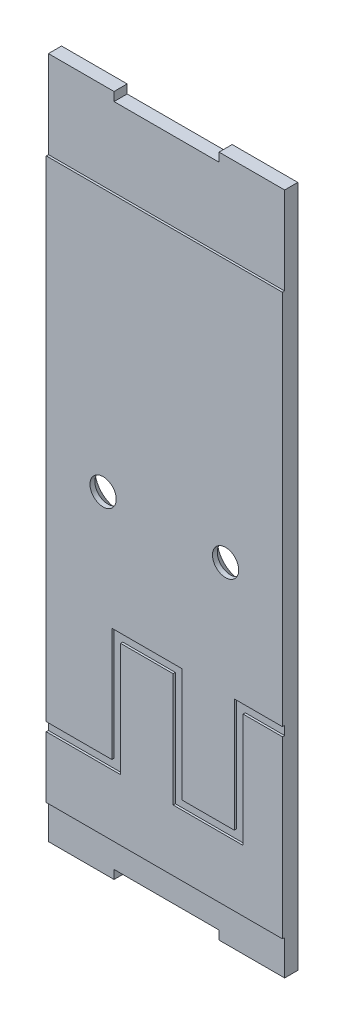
ISO-10303-21;
HEADER;
FILE_DESCRIPTION(('STEP AP214'),'2;1');
FILE_NAME('part.step','',(''),(''),'','','');
FILE_SCHEMA(('AUTOMOTIVE_DESIGN { 1 0 10303 214 1 1 1 1 }'));
ENDSEC;
DATA;
#1=APPLICATION_CONTEXT('core data for automotive mechanical design processes');
#2=APPLICATION_PROTOCOL_DEFINITION('international standard','automotive_design',2000,#1);
#3=PRODUCT_CONTEXT('',#1,'mechanical');
#4=PRODUCT('Part','Part','',(#3));
#5=PRODUCT_RELATED_PRODUCT_CATEGORY('part','',(#4));
#6=PRODUCT_DEFINITION_FORMATION('','',#4);
#7=PRODUCT_DEFINITION_CONTEXT('part definition',#1,'design');
#8=PRODUCT_DEFINITION('design','',#6,#7);
#9=PRODUCT_DEFINITION_SHAPE('','',#8);
#10=(LENGTH_UNIT() NAMED_UNIT(*) SI_UNIT(.MILLI.,.METRE.));
#11=(NAMED_UNIT(*) PLANE_ANGLE_UNIT() SI_UNIT($,.RADIAN.));
#12=(NAMED_UNIT(*) SI_UNIT($,.STERADIAN.) SOLID_ANGLE_UNIT());
#13=UNCERTAINTY_MEASURE_WITH_UNIT(LENGTH_MEASURE(1.E-05),#10,'distance_accuracy_value','');
#14=(GEOMETRIC_REPRESENTATION_CONTEXT(3) GLOBAL_UNCERTAINTY_ASSIGNED_CONTEXT((#13)) GLOBAL_UNIT_ASSIGNED_CONTEXT((#10,
#11,#12)) REPRESENTATION_CONTEXT('',''));
#15=CARTESIAN_POINT('',(0.,0.,0.));
#16=DIRECTION('',(0.,0.,1.));
#17=DIRECTION('',(1.,0.,0.));
#18=AXIS2_PLACEMENT_3D('',#15,#16,#17);
#19=CARTESIAN_POINT('',(0.,0.,1.5));
#20=DIRECTION('',(0.,1.,0.));
#21=DIRECTION('',(0.,0.,1.));
#22=AXIS2_PLACEMENT_3D('',#19,#20,#21);
#23=PLANE('',#22);
#24=DIRECTION('',(1.,0.,0.));
#25=VECTOR('',#24,1.);
#26=CARTESIAN_POINT('',(0.,0.,0.));
#27=LINE('',#26,#25);
#28=CARTESIAN_POINT('',(0.,0.,0.));
#29=VERTEX_POINT('',#28);
#30=CARTESIAN_POINT('',(7.50000000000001,0.,0.));
#31=VERTEX_POINT('',#30);
#32=EDGE_CURVE('E262',#29,#31,#27,.T.);
#33=ORIENTED_EDGE('',*,*,#32,.T.);
#34=DIRECTION('',(0.,0.,1.));
#35=VECTOR('',#34,1.);
#36=CARTESIAN_POINT('',(7.50000000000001,0.,0.));
#37=LINE('',#36,#35);
#38=CARTESIAN_POINT('',(7.50000000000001,0.,1.5));
#39=VERTEX_POINT('',#38);
#40=EDGE_CURVE('E245',#31,#39,#37,.T.);
#41=ORIENTED_EDGE('',*,*,#40,.T.);
#42=DIRECTION('',(1.,0.,0.));
#43=VECTOR('',#42,1.);
#44=CARTESIAN_POINT('',(0.,0.,1.5));
#45=LINE('',#44,#43);
#46=CARTESIAN_POINT('',(0.,0.,1.5));
#47=VERTEX_POINT('',#46);
#48=EDGE_CURVE('E353',#47,#39,#45,.T.);
#49=ORIENTED_EDGE('',*,*,#48,.F.);
#50=DIRECTION('',(0.,0.,-1.));
#51=VECTOR('',#50,1.);
#52=CARTESIAN_POINT('',(0.,0.,1.5));
#53=LINE('',#52,#51);
#54=EDGE_CURVE('E270',#47,#29,#53,.T.);
#55=ORIENTED_EDGE('',*,*,#54,.T.);
#56=EDGE_LOOP('',(#33,#41,#49,#55));
#57=FACE_BOUND('',#56,.T.);
#58=ADVANCED_FACE('F35',(#57),#23,.F.);
#59=CARTESIAN_POINT('',(0.,78.,1.5));
#60=DIRECTION('',(0.,-1.,0.));
#61=DIRECTION('',(0.,0.,-1.));
#62=AXIS2_PLACEMENT_3D('',#59,#60,#61);
#63=PLANE('',#62);
#64=DIRECTION('',(-1.,0.,0.));
#65=VECTOR('',#64,1.);
#66=CARTESIAN_POINT('',(0.,78.,1.5));
#67=LINE('',#66,#65);
#68=CARTESIAN_POINT('',(7.5,78.,1.5));
#69=VERTEX_POINT('',#68);
#70=CARTESIAN_POINT('',(0.,78.,1.5));
#71=VERTEX_POINT('',#70);
#72=EDGE_CURVE('E382',#69,#71,#67,.T.);
#73=ORIENTED_EDGE('',*,*,#72,.F.);
#74=DIRECTION('',(0.,0.,1.));
#75=VECTOR('',#74,1.);
#76=CARTESIAN_POINT('',(7.5,78.,0.));
#77=LINE('',#76,#75);
#78=CARTESIAN_POINT('',(7.5,78.,0.));
#79=VERTEX_POINT('',#78);
#80=EDGE_CURVE('E430',#79,#69,#77,.T.);
#81=ORIENTED_EDGE('',*,*,#80,.F.);
#82=DIRECTION('',(-1.,0.,0.));
#83=VECTOR('',#82,1.);
#84=CARTESIAN_POINT('',(0.,78.,0.));
#85=LINE('',#84,#83);
#86=CARTESIAN_POINT('',(0.,78.,0.));
#87=VERTEX_POINT('',#86);
#88=EDGE_CURVE('E275',#79,#87,#85,.T.);
#89=ORIENTED_EDGE('',*,*,#88,.T.);
#90=DIRECTION('',(0.,0.,-1.));
#91=VECTOR('',#90,1.);
#92=CARTESIAN_POINT('',(0.,78.,1.5));
#93=LINE('',#92,#91);
#94=EDGE_CURVE('E284',#71,#87,#93,.T.);
#95=ORIENTED_EDGE('',*,*,#94,.F.);
#96=EDGE_LOOP('',(#73,#81,#89,#95));
#97=FACE_BOUND('',#96,.T.);
#98=ADVANCED_FACE('F323',(#97),#63,.F.);
#99=CARTESIAN_POINT('',(0.,0.,1.75));
#100=DIRECTION('',(0.,0.,1.));
#101=DIRECTION('',(1.,0.,0.));
#102=AXIS2_PLACEMENT_3D('',#99,#100,#101);
#103=PLANE('',#102);
#104=DIRECTION('',(-1.,0.,0.));
#105=VECTOR('',#104,1.);
#106=CARTESIAN_POINT('',(0.,12.,1.75));
#107=LINE('',#106,#105);
#108=CARTESIAN_POINT('',(7.5,12.,1.75));
#109=VERTEX_POINT('',#108);
#110=CARTESIAN_POINT('',(0.,12.,1.75));
#111=VERTEX_POINT('',#110);
#112=EDGE_CURVE('E519',#109,#111,#107,.T.);
#113=ORIENTED_EDGE('',*,*,#112,.F.);
#114=DIRECTION('',(0.,-1.,0.));
#115=VECTOR('',#114,1.);
#116=CARTESIAN_POINT('',(7.5,25.,1.75));
#117=LINE('',#116,#115);
#118=CARTESIAN_POINT('',(7.5,25.,1.75));
#119=VERTEX_POINT('',#118);
#120=EDGE_CURVE('E516',#119,#109,#117,.T.);
#121=ORIENTED_EDGE('',*,*,#120,.F.);
#122=DIRECTION('',(-1.,0.,0.));
#123=VECTOR('',#122,1.);
#124=CARTESIAN_POINT('',(15.5,25.,1.75));
#125=LINE('',#124,#123);
#126=CARTESIAN_POINT('',(15.5,25.,1.75));
#127=VERTEX_POINT('',#126);
#128=EDGE_CURVE('E513',#127,#119,#125,.T.);
#129=ORIENTED_EDGE('',*,*,#128,.F.);
#130=DIRECTION('',(0.,1.,0.));
#131=VECTOR('',#130,1.);
#132=CARTESIAN_POINT('',(15.5,25.,1.75));
#133=LINE('',#132,#131);
#134=CARTESIAN_POINT('',(15.5,12.,1.75));
#135=VERTEX_POINT('',#134);
#136=EDGE_CURVE('E510',#135,#127,#133,.T.);
#137=ORIENTED_EDGE('',*,*,#136,.F.);
#138=DIRECTION('',(-1.,0.,0.));
#139=VECTOR('',#138,1.);
#140=CARTESIAN_POINT('',(15.5,12.,1.75));
#141=LINE('',#140,#139);
#142=CARTESIAN_POINT('',(21.5,12.,1.75));
#143=VERTEX_POINT('',#142);
#144=EDGE_CURVE('E507',#143,#135,#141,.T.);
#145=ORIENTED_EDGE('',*,*,#144,.F.);
#146=DIRECTION('',(0.,-1.,0.));
#147=VECTOR('',#146,1.);
#148=CARTESIAN_POINT('',(21.5,25.,1.75));
#149=LINE('',#148,#147);
#150=CARTESIAN_POINT('',(21.5,25.,1.75));
#151=VERTEX_POINT('',#150);
#152=EDGE_CURVE('E504',#151,#143,#149,.T.);
#153=ORIENTED_EDGE('',*,*,#152,.F.);
#154=DIRECTION('',(-1.,0.,0.));
#155=VECTOR('',#154,1.);
#156=CARTESIAN_POINT('',(21.5,25.,1.75));
#157=LINE('',#156,#155);
#158=CARTESIAN_POINT('',(27.,25.,1.75));
#159=VERTEX_POINT('',#158);
#160=EDGE_CURVE('E412',#159,#151,#157,.T.);
#161=ORIENTED_EDGE('',*,*,#160,.F.);
#162=DIRECTION('',(0.,1.,0.));
#163=VECTOR('',#162,1.);
#164=CARTESIAN_POINT('',(27.,0.,1.75));
#165=LINE('',#164,#163);
#166=CARTESIAN_POINT('',(27.,68.,1.75));
#167=VERTEX_POINT('',#166);
#168=EDGE_CURVE('E396',#159,#167,#165,.T.);
#169=ORIENTED_EDGE('',*,*,#168,.T.);
#170=DIRECTION('',(1.,0.,0.));
#171=VECTOR('',#170,1.);
#172=CARTESIAN_POINT('',(0.,68.,1.75));
#173=LINE('',#172,#171);
#174=CARTESIAN_POINT('',(0.,68.,1.75));
#175=VERTEX_POINT('',#174);
#176=EDGE_CURVE('E372',#175,#167,#173,.T.);
#177=ORIENTED_EDGE('',*,*,#176,.F.);
#178=DIRECTION('',(0.,-1.,0.));
#179=VECTOR('',#178,1.);
#180=CARTESIAN_POINT('',(0.,78.,1.75));
#181=LINE('',#180,#179);
#182=EDGE_CURVE('E394',#175,#111,#181,.T.);
#183=ORIENTED_EDGE('',*,*,#182,.T.);
#184=EDGE_LOOP('',(#113,#121,#129,#137,#145,#153,#161,#169,#177,#183));
#185=FACE_BOUND('',#184,.T.);
#186=CARTESIAN_POINT('',(6.50000000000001,38.,1.75));
#187=DIRECTION('',(0.,0.,1.));
#188=DIRECTION('',(-1.,0.,0.));
#189=AXIS2_PLACEMENT_3D('',#186,#187,#188);
#190=CIRCLE('',#189,1.5);
#191=CARTESIAN_POINT('',(5.,38.,1.75));
#192=VERTEX_POINT('',#191);
#193=EDGE_CURVE('E528',#192,#192,#190,.T.);
#194=ORIENTED_EDGE('',*,*,#193,.F.);
#195=EDGE_LOOP('',(#194));
#196=FACE_BOUND('',#195,.T.);
#197=CARTESIAN_POINT('',(20.5,38.,1.75));
#198=DIRECTION('',(0.,0.,1.));
#199=DIRECTION('',(1.,0.,0.));
#200=AXIS2_PLACEMENT_3D('',#197,#198,#199);
#201=CIRCLE('',#200,1.5);
#202=CARTESIAN_POINT('',(22.,38.,1.75));
#203=VERTEX_POINT('',#202);
#204=EDGE_CURVE('E368',#203,#203,#201,.T.);
#205=ORIENTED_EDGE('',*,*,#204,.F.);
#206=EDGE_LOOP('',(#205));
#207=FACE_BOUND('',#206,.T.);
#208=ADVANCED_FACE('F330',(#185,#196,#207),#103,.T.);
#209=CARTESIAN_POINT('',(27.,78.,0.));
#210=VERTEX_POINT('',#209);
#211=CARTESIAN_POINT('',(19.5,78.,0.));
#212=VERTEX_POINT('',#211);
#213=EDGE_CURVE('E281',#210,#212,#85,.T.);
#214=ORIENTED_EDGE('',*,*,#213,.T.);
#215=DIRECTION('',(0.,0.,1.));
#216=VECTOR('',#215,1.);
#217=CARTESIAN_POINT('',(19.5,78.,0.));
#218=LINE('',#217,#216);
#219=CARTESIAN_POINT('',(19.5,78.,1.5));
#220=VERTEX_POINT('',#219);
#221=EDGE_CURVE('E425',#212,#220,#218,.T.);
#222=ORIENTED_EDGE('',*,*,#221,.T.);
#223=CARTESIAN_POINT('',(27.,78.,1.5));
#224=VERTEX_POINT('',#223);
#225=EDGE_CURVE('E383',#224,#220,#67,.T.);
#226=ORIENTED_EDGE('',*,*,#225,.F.);
#227=DIRECTION('',(0.,0.,-1.));
#228=VECTOR('',#227,1.);
#229=CARTESIAN_POINT('',(27.,78.,1.5));
#230=LINE('',#229,#228);
#231=EDGE_CURVE('E287',#224,#210,#230,.T.);
#232=ORIENTED_EDGE('',*,*,#231,.T.);
#233=EDGE_LOOP('',(#214,#222,#226,#232));
#234=FACE_BOUND('',#233,.T.);
#235=ADVANCED_FACE('F333',(#234),#63,.F.);
#236=CARTESIAN_POINT('',(0.,0.,1.5));
#237=DIRECTION('',(1.,0.,0.));
#238=DIRECTION('',(0.,0.,-1.));
#239=AXIS2_PLACEMENT_3D('',#236,#237,#238);
#240=PLANE('',#239);
#241=CARTESIAN_POINT('',(0.,11.,1.75));
#242=VERTEX_POINT('',#241);
#243=CARTESIAN_POINT('',(0.,4.,1.75));
#244=VERTEX_POINT('',#243);
#245=EDGE_CURVE('E392',#242,#244,#181,.T.);
#246=ORIENTED_EDGE('',*,*,#245,.F.);
#247=DIRECTION('',(0.,0.,1.));
#248=VECTOR('',#247,1.);
#249=CARTESIAN_POINT('',(0.,11.,1.5));
#250=LINE('',#249,#248);
#251=CARTESIAN_POINT('',(0.,11.,1.5));
#252=VERTEX_POINT('',#251);
#253=EDGE_CURVE('E531',#252,#242,#250,.T.);
#254=ORIENTED_EDGE('',*,*,#253,.F.);
#255=DIRECTION('',(0.,-1.,0.));
#256=VECTOR('',#255,1.);
#257=CARTESIAN_POINT('',(0.,12.,1.5));
#258=LINE('',#257,#256);
#259=CARTESIAN_POINT('',(0.,12.,1.5));
#260=VERTEX_POINT('',#259);
#261=EDGE_CURVE('E481',#260,#252,#258,.T.);
#262=ORIENTED_EDGE('',*,*,#261,.F.);
#263=DIRECTION('',(0.,0.,1.));
#264=VECTOR('',#263,1.);
#265=CARTESIAN_POINT('',(0.,12.,1.5));
#266=LINE('',#265,#264);
#267=EDGE_CURVE('E533',#260,#111,#266,.T.);
#268=ORIENTED_EDGE('',*,*,#267,.T.);
#269=ORIENTED_EDGE('',*,*,#182,.F.);
#270=DIRECTION('',(0.,0.,1.));
#271=VECTOR('',#270,1.);
#272=CARTESIAN_POINT('',(0.,68.,1.5));
#273=LINE('',#272,#271);
#274=CARTESIAN_POINT('',(0.,68.,1.5));
#275=VERTEX_POINT('',#274);
#276=EDGE_CURVE('E386',#275,#175,#273,.T.);
#277=ORIENTED_EDGE('',*,*,#276,.F.);
#278=DIRECTION('',(0.,-1.,0.));
#279=VECTOR('',#278,1.);
#280=CARTESIAN_POINT('',(0.,78.,1.5));
#281=LINE('',#280,#279);
#282=EDGE_CURVE('E374',#71,#275,#281,.T.);
#283=ORIENTED_EDGE('',*,*,#282,.F.);
#284=ORIENTED_EDGE('',*,*,#94,.T.);
#285=DIRECTION('',(0.,-1.,0.));
#286=VECTOR('',#285,1.);
#287=CARTESIAN_POINT('',(0.,0.,0.));
#288=LINE('',#287,#286);
#289=EDGE_CURVE('E277',#87,#29,#288,.T.);
#290=ORIENTED_EDGE('',*,*,#289,.T.);
#291=ORIENTED_EDGE('',*,*,#54,.F.);
#292=DIRECTION('',(0.,-1.,0.));
#293=VECTOR('',#292,1.);
#294=CARTESIAN_POINT('',(0.,0.,1.5));
#295=LINE('',#294,#293);
#296=CARTESIAN_POINT('',(0.,4.,1.5));
#297=VERTEX_POINT('',#296);
#298=EDGE_CURVE('E354',#297,#47,#295,.T.);
#299=ORIENTED_EDGE('',*,*,#298,.F.);
#300=DIRECTION('',(0.,0.,1.));
#301=VECTOR('',#300,1.);
#302=CARTESIAN_POINT('',(0.,4.,1.5));
#303=LINE('',#302,#301);
#304=EDGE_CURVE('E369',#297,#244,#303,.T.);
#305=ORIENTED_EDGE('',*,*,#304,.T.);
#306=EDGE_LOOP('',(#246,#254,#262,#268,#269,#277,#283,#284,#290,#291,#299,#305));
#307=FACE_BOUND('',#306,.T.);
#308=ADVANCED_FACE('F337',(#307),#240,.F.);
#309=CARTESIAN_POINT('',(19.5,0.,1.5));
#310=VERTEX_POINT('',#309);
#311=CARTESIAN_POINT('',(27.,0.,1.5));
#312=VERTEX_POINT('',#311);
#313=EDGE_CURVE('E349',#310,#312,#45,.T.);
#314=ORIENTED_EDGE('',*,*,#313,.F.);
#315=DIRECTION('',(0.,0.,1.));
#316=VECTOR('',#315,1.);
#317=CARTESIAN_POINT('',(19.5,0.,0.));
#318=LINE('',#317,#316);
#319=CARTESIAN_POINT('',(19.5,0.,0.));
#320=VERTEX_POINT('',#319);
#321=EDGE_CURVE('E50',#320,#310,#318,.T.);
#322=ORIENTED_EDGE('',*,*,#321,.F.);
#323=CARTESIAN_POINT('',(27.,0.,0.));
#324=VERTEX_POINT('',#323);
#325=EDGE_CURVE('E272',#320,#324,#27,.T.);
#326=ORIENTED_EDGE('',*,*,#325,.T.);
#327=DIRECTION('',(0.,0.,-1.));
#328=VECTOR('',#327,1.);
#329=CARTESIAN_POINT('',(27.,0.,1.5));
#330=LINE('',#329,#328);
#331=EDGE_CURVE('E289',#312,#324,#330,.T.);
#332=ORIENTED_EDGE('',*,*,#331,.F.);
#333=EDGE_LOOP('',(#314,#322,#326,#332));
#334=FACE_BOUND('',#333,.T.);
#335=ADVANCED_FACE('F325',(#334),#23,.F.);
#336=CARTESIAN_POINT('',(27.,0.,1.5));
#337=DIRECTION('',(-1.,0.,0.));
#338=DIRECTION('',(0.,0.,1.));
#339=AXIS2_PLACEMENT_3D('',#336,#337,#338);
#340=PLANE('',#339);
#341=ORIENTED_EDGE('',*,*,#168,.F.);
#342=DIRECTION('',(0.,0.,1.));
#343=VECTOR('',#342,1.);
#344=CARTESIAN_POINT('',(27.,25.,1.5));
#345=LINE('',#344,#343);
#346=CARTESIAN_POINT('',(27.,25.,1.5));
#347=VERTEX_POINT('',#346);
#348=EDGE_CURVE('E548',#347,#159,#345,.T.);
#349=ORIENTED_EDGE('',*,*,#348,.F.);
#350=DIRECTION('',(0.,1.,0.));
#351=VECTOR('',#350,1.);
#352=CARTESIAN_POINT('',(27.,25.,1.5));
#353=LINE('',#352,#351);
#354=CARTESIAN_POINT('',(27.,24.,1.5));
#355=VERTEX_POINT('',#354);
#356=EDGE_CURVE('E457',#355,#347,#353,.T.);
#357=ORIENTED_EDGE('',*,*,#356,.F.);
#358=DIRECTION('',(0.,0.,1.));
#359=VECTOR('',#358,1.);
#360=CARTESIAN_POINT('',(27.,24.,1.5));
#361=LINE('',#360,#359);
#362=CARTESIAN_POINT('',(27.,24.,1.75));
#363=VERTEX_POINT('',#362);
#364=EDGE_CURVE('E550',#355,#363,#361,.T.);
#365=ORIENTED_EDGE('',*,*,#364,.T.);
#366=CARTESIAN_POINT('',(27.,4.,1.75));
#367=VERTEX_POINT('',#366);
#368=EDGE_CURVE('E397',#367,#363,#165,.T.);
#369=ORIENTED_EDGE('',*,*,#368,.F.);
#370=DIRECTION('',(0.,0.,1.));
#371=VECTOR('',#370,1.);
#372=CARTESIAN_POINT('',(27.,4.,1.5));
#373=LINE('',#372,#371);
#374=CARTESIAN_POINT('',(27.,4.,1.5));
#375=VERTEX_POINT('',#374);
#376=EDGE_CURVE('E365',#375,#367,#373,.T.);
#377=ORIENTED_EDGE('',*,*,#376,.F.);
#378=DIRECTION('',(0.,1.,0.));
#379=VECTOR('',#378,1.);
#380=CARTESIAN_POINT('',(27.,0.,1.5));
#381=LINE('',#380,#379);
#382=EDGE_CURVE('E356',#312,#375,#381,.T.);
#383=ORIENTED_EDGE('',*,*,#382,.F.);
#384=ORIENTED_EDGE('',*,*,#331,.T.);
#385=DIRECTION('',(0.,1.,0.));
#386=VECTOR('',#385,1.);
#387=CARTESIAN_POINT('',(27.,0.,0.));
#388=LINE('',#387,#386);
#389=EDGE_CURVE('E271',#324,#210,#388,.T.);
#390=ORIENTED_EDGE('',*,*,#389,.T.);
#391=ORIENTED_EDGE('',*,*,#231,.F.);
#392=DIRECTION('',(0.,1.,0.));
#393=VECTOR('',#392,1.);
#394=CARTESIAN_POINT('',(27.,78.,1.5));
#395=LINE('',#394,#393);
#396=CARTESIAN_POINT('',(27.,68.,1.5));
#397=VERTEX_POINT('',#396);
#398=EDGE_CURVE('E380',#397,#224,#395,.T.);
#399=ORIENTED_EDGE('',*,*,#398,.F.);
#400=DIRECTION('',(0.,0.,1.));
#401=VECTOR('',#400,1.);
#402=CARTESIAN_POINT('',(27.,68.,1.5));
#403=LINE('',#402,#401);
#404=EDGE_CURVE('E389',#397,#167,#403,.T.);
#405=ORIENTED_EDGE('',*,*,#404,.T.);
#406=EDGE_LOOP('',(#341,#349,#357,#365,#369,#377,#383,#384,#390,#391,#399,#405));
#407=FACE_BOUND('',#406,.T.);
#408=ADVANCED_FACE('F313',(#407),#340,.F.);
#409=CARTESIAN_POINT('',(0.,0.,0.));
#410=DIRECTION('',(0.,0.,-1.));
#411=DIRECTION('',(-1.,0.,0.));
#412=AXIS2_PLACEMENT_3D('',#409,#410,#411);
#413=PLANE('',#412);
#414=CARTESIAN_POINT('',(6.50000000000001,38.,0.));
#415=DIRECTION('',(0.,0.,-1.));
#416=DIRECTION('',(-1.,0.,0.));
#417=AXIS2_PLACEMENT_3D('',#414,#415,#416);
#418=CIRCLE('',#417,2.70000000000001);
#419=CARTESIAN_POINT('',(3.8,38.,0.));
#420=VERTEX_POINT('',#419);
#421=EDGE_CURVE('E296',#420,#420,#418,.F.);
#422=ORIENTED_EDGE('',*,*,#421,.T.);
#423=EDGE_LOOP('',(#422));
#424=FACE_BOUND('',#423,.T.);
#425=CARTESIAN_POINT('',(20.5,38.,0.));
#426=DIRECTION('',(0.,0.,-1.));
#427=DIRECTION('',(-1.,0.,0.));
#428=AXIS2_PLACEMENT_3D('',#425,#426,#427);
#429=CIRCLE('',#428,2.7);
#430=CARTESIAN_POINT('',(17.8,38.,0.));
#431=VERTEX_POINT('',#430);
#432=EDGE_CURVE('E293',#431,#431,#429,.F.);
#433=ORIENTED_EDGE('',*,*,#432,.T.);
#434=EDGE_LOOP('',(#433));
#435=FACE_BOUND('',#434,.T.);
#436=DIRECTION('',(0.,-1.,0.));
#437=VECTOR('',#436,1.);
#438=CARTESIAN_POINT('',(7.50000000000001,0.,0.));
#439=LINE('',#438,#437);
#440=CARTESIAN_POINT('',(7.50000000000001,1.,0.));
#441=VERTEX_POINT('',#440);
#442=EDGE_CURVE('E248',#441,#31,#439,.T.);
#443=ORIENTED_EDGE('',*,*,#442,.T.);
#444=ORIENTED_EDGE('',*,*,#32,.F.);
#445=ORIENTED_EDGE('',*,*,#289,.F.);
#446=ORIENTED_EDGE('',*,*,#88,.F.);
#447=DIRECTION('',(0.,-1.,0.));
#448=VECTOR('',#447,1.);
#449=CARTESIAN_POINT('',(7.5,78.,0.));
#450=LINE('',#449,#448);
#451=CARTESIAN_POINT('',(7.5,77.,0.));
#452=VERTEX_POINT('',#451);
#453=EDGE_CURVE('E945',#79,#452,#450,.T.);
#454=ORIENTED_EDGE('',*,*,#453,.T.);
#455=DIRECTION('',(1.,0.,0.));
#456=VECTOR('',#455,1.);
#457=CARTESIAN_POINT('',(7.5,77.,0.));
#458=LINE('',#457,#456);
#459=CARTESIAN_POINT('',(19.5,77.,0.));
#460=VERTEX_POINT('',#459);
#461=EDGE_CURVE('E948',#452,#460,#458,.T.);
#462=ORIENTED_EDGE('',*,*,#461,.T.);
#463=DIRECTION('',(0.,1.,0.));
#464=VECTOR('',#463,1.);
#465=CARTESIAN_POINT('',(19.5,78.,0.));
#466=LINE('',#465,#464);
#467=EDGE_CURVE('E440',#460,#212,#466,.T.);
#468=ORIENTED_EDGE('',*,*,#467,.T.);
#469=ORIENTED_EDGE('',*,*,#213,.F.);
#470=ORIENTED_EDGE('',*,*,#389,.F.);
#471=ORIENTED_EDGE('',*,*,#325,.F.);
#472=DIRECTION('',(0.,1.,0.));
#473=VECTOR('',#472,1.);
#474=CARTESIAN_POINT('',(19.5,0.,0.));
#475=LINE('',#474,#473);
#476=CARTESIAN_POINT('',(19.5,1.,0.));
#477=VERTEX_POINT('',#476);
#478=EDGE_CURVE('E266',#320,#477,#475,.T.);
#479=ORIENTED_EDGE('',*,*,#478,.T.);
#480=DIRECTION('',(-1.,0.,0.));
#481=VECTOR('',#480,1.);
#482=CARTESIAN_POINT('',(7.50000000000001,1.,0.));
#483=LINE('',#482,#481);
#484=EDGE_CURVE('E256',#477,#441,#483,.T.);
#485=ORIENTED_EDGE('',*,*,#484,.T.);
#486=EDGE_LOOP('',(#443,#444,#445,#446,#454,#462,#468,#469,#470,#471,#479,#485));
#487=FACE_BOUND('',#486,.T.);
#488=ADVANCED_FACE('F260',(#424,#435,#487),#413,.T.);
#489=DIRECTION('',(1.,0.,0.));
#490=VECTOR('',#489,1.);
#491=CARTESIAN_POINT('',(8.5,11.,1.75));
#492=LINE('',#491,#490);
#493=CARTESIAN_POINT('',(8.5,11.,1.75));
#494=VERTEX_POINT('',#493);
#495=EDGE_CURVE('E521',#242,#494,#492,.T.);
#496=ORIENTED_EDGE('',*,*,#495,.F.);
#497=ORIENTED_EDGE('',*,*,#245,.T.);
#498=DIRECTION('',(-1.,0.,0.));
#499=VECTOR('',#498,1.);
#500=CARTESIAN_POINT('',(0.,4.,1.75));
#501=LINE('',#500,#499);
#502=EDGE_CURVE('E357',#367,#244,#501,.T.);
#503=ORIENTED_EDGE('',*,*,#502,.F.);
#504=ORIENTED_EDGE('',*,*,#368,.T.);
#505=DIRECTION('',(1.,0.,0.));
#506=VECTOR('',#505,1.);
#507=CARTESIAN_POINT('',(22.5,24.,1.75));
#508=LINE('',#507,#506);
#509=CARTESIAN_POINT('',(22.5,24.,1.75));
#510=VERTEX_POINT('',#509);
#511=EDGE_CURVE('E501',#510,#363,#508,.T.);
#512=ORIENTED_EDGE('',*,*,#511,.F.);
#513=DIRECTION('',(0.,1.,0.));
#514=VECTOR('',#513,1.);
#515=CARTESIAN_POINT('',(22.5,24.,1.75));
#516=LINE('',#515,#514);
#517=CARTESIAN_POINT('',(22.5,11.,1.75));
#518=VERTEX_POINT('',#517);
#519=EDGE_CURVE('E498',#518,#510,#516,.T.);
#520=ORIENTED_EDGE('',*,*,#519,.F.);
#521=DIRECTION('',(1.,0.,0.));
#522=VECTOR('',#521,1.);
#523=CARTESIAN_POINT('',(22.5,11.,1.75));
#524=LINE('',#523,#522);
#525=CARTESIAN_POINT('',(14.5,11.,1.75));
#526=VERTEX_POINT('',#525);
#527=EDGE_CURVE('E495',#526,#518,#524,.T.);
#528=ORIENTED_EDGE('',*,*,#527,.F.);
#529=DIRECTION('',(0.,-1.,0.));
#530=VECTOR('',#529,1.);
#531=CARTESIAN_POINT('',(14.5,24.,1.75));
#532=LINE('',#531,#530);
#533=CARTESIAN_POINT('',(14.5,24.,1.75));
#534=VERTEX_POINT('',#533);
#535=EDGE_CURVE('E492',#534,#526,#532,.T.);
#536=ORIENTED_EDGE('',*,*,#535,.F.);
#537=DIRECTION('',(1.,0.,0.));
#538=VECTOR('',#537,1.);
#539=CARTESIAN_POINT('',(8.5,24.,1.75));
#540=LINE('',#539,#538);
#541=CARTESIAN_POINT('',(8.5,24.,1.75));
#542=VERTEX_POINT('',#541);
#543=EDGE_CURVE('E433',#542,#534,#540,.T.);
#544=ORIENTED_EDGE('',*,*,#543,.F.);
#545=DIRECTION('',(0.,1.,0.));
#546=VECTOR('',#545,1.);
#547=CARTESIAN_POINT('',(8.5,24.,1.75));
#548=LINE('',#547,#546);
#549=EDGE_CURVE('E445',#494,#542,#548,.T.);
#550=ORIENTED_EDGE('',*,*,#549,.F.);
#551=EDGE_LOOP('',(#496,#497,#503,#504,#512,#520,#528,#536,#544,#550));
#552=FACE_BOUND('',#551,.T.);
#553=ADVANCED_FACE('F312',(#552),#103,.T.);
#554=CARTESIAN_POINT('',(0.,68.,1.5));
#555=DIRECTION('',(0.,-1.,0.));
#556=DIRECTION('',(0.,0.,-1.));
#557=AXIS2_PLACEMENT_3D('',#554,#555,#556);
#558=PLANE('',#557);
#559=ORIENTED_EDGE('',*,*,#176,.T.);
#560=ORIENTED_EDGE('',*,*,#404,.F.);
#561=DIRECTION('',(1.,0.,0.));
#562=VECTOR('',#561,1.);
#563=CARTESIAN_POINT('',(0.,68.,1.5));
#564=LINE('',#563,#562);
#565=EDGE_CURVE('E377',#275,#397,#564,.T.);
#566=ORIENTED_EDGE('',*,*,#565,.F.);
#567=ORIENTED_EDGE('',*,*,#276,.T.);
#568=EDGE_LOOP('',(#559,#560,#566,#567));
#569=FACE_BOUND('',#568,.T.);
#570=ADVANCED_FACE('F415',(#569),#558,.F.);
#571=CARTESIAN_POINT('',(0.,0.,1.5));
#572=DIRECTION('',(0.,0.,1.));
#573=DIRECTION('',(1.,0.,0.));
#574=AXIS2_PLACEMENT_3D('',#571,#572,#573);
#575=PLANE('',#574);
#576=DIRECTION('',(0.,-1.,0.));
#577=VECTOR('',#576,1.);
#578=CARTESIAN_POINT('',(7.5,78.,1.5));
#579=LINE('',#578,#577);
#580=CARTESIAN_POINT('',(7.5,77.,1.5));
#581=VERTEX_POINT('',#580);
#582=EDGE_CURVE('E58',#69,#581,#579,.T.);
#583=ORIENTED_EDGE('',*,*,#582,.F.);
#584=ORIENTED_EDGE('',*,*,#72,.T.);
#585=ORIENTED_EDGE('',*,*,#282,.T.);
#586=ORIENTED_EDGE('',*,*,#565,.T.);
#587=ORIENTED_EDGE('',*,*,#398,.T.);
#588=ORIENTED_EDGE('',*,*,#225,.T.);
#589=DIRECTION('',(0.,1.,0.));
#590=VECTOR('',#589,1.);
#591=CARTESIAN_POINT('',(19.5,78.,1.5));
#592=LINE('',#591,#590);
#593=CARTESIAN_POINT('',(19.5,77.,1.5));
#594=VERTEX_POINT('',#593);
#595=EDGE_CURVE('E949',#594,#220,#592,.T.);
#596=ORIENTED_EDGE('',*,*,#595,.F.);
#597=DIRECTION('',(1.,0.,0.));
#598=VECTOR('',#597,1.);
#599=CARTESIAN_POINT('',(7.5,77.,1.5));
#600=LINE('',#599,#598);
#601=EDGE_CURVE('E954',#581,#594,#600,.T.);
#602=ORIENTED_EDGE('',*,*,#601,.F.);
#603=EDGE_LOOP('',(#583,#584,#585,#586,#587,#588,#596,#602));
#604=FACE_BOUND('',#603,.T.);
#605=ADVANCED_FACE('F421',(#604),#575,.T.);
#606=CARTESIAN_POINT('',(0.,4.,1.5));
#607=DIRECTION('',(0.,1.,0.));
#608=DIRECTION('',(0.,0.,1.));
#609=AXIS2_PLACEMENT_3D('',#606,#607,#608);
#610=PLANE('',#609);
#611=ORIENTED_EDGE('',*,*,#502,.T.);
#612=ORIENTED_EDGE('',*,*,#304,.F.);
#613=DIRECTION('',(-1.,0.,0.));
#614=VECTOR('',#613,1.);
#615=CARTESIAN_POINT('',(0.,4.,1.5));
#616=LINE('',#615,#614);
#617=EDGE_CURVE('E362',#375,#297,#616,.T.);
#618=ORIENTED_EDGE('',*,*,#617,.F.);
#619=ORIENTED_EDGE('',*,*,#376,.T.);
#620=EDGE_LOOP('',(#611,#612,#618,#619));
#621=FACE_BOUND('',#620,.T.);
#622=ADVANCED_FACE('F588',(#621),#610,.F.);
#623=CARTESIAN_POINT('',(0.,0.,1.5));
#624=DIRECTION('',(0.,0.,-1.));
#625=DIRECTION('',(-1.,0.,0.));
#626=AXIS2_PLACEMENT_3D('',#623,#624,#625);
#627=PLANE('',#626);
#628=ORIENTED_EDGE('',*,*,#48,.T.);
#629=DIRECTION('',(0.,-1.,0.));
#630=VECTOR('',#629,1.);
#631=CARTESIAN_POINT('',(7.50000000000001,0.,1.5));
#632=LINE('',#631,#630);
#633=CARTESIAN_POINT('',(7.50000000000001,1.,1.5));
#634=VERTEX_POINT('',#633);
#635=EDGE_CURVE('E251',#634,#39,#632,.T.);
#636=ORIENTED_EDGE('',*,*,#635,.F.);
#637=DIRECTION('',(-1.,0.,0.));
#638=VECTOR('',#637,1.);
#639=CARTESIAN_POINT('',(7.50000000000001,1.,1.5));
#640=LINE('',#639,#638);
#641=CARTESIAN_POINT('',(19.5,1.,1.5));
#642=VERTEX_POINT('',#641);
#643=EDGE_CURVE('E267',#642,#634,#640,.T.);
#644=ORIENTED_EDGE('',*,*,#643,.F.);
#645=DIRECTION('',(0.,1.,0.));
#646=VECTOR('',#645,1.);
#647=CARTESIAN_POINT('',(19.5,0.,1.5));
#648=LINE('',#647,#646);
#649=EDGE_CURVE('E933',#310,#642,#648,.T.);
#650=ORIENTED_EDGE('',*,*,#649,.F.);
#651=ORIENTED_EDGE('',*,*,#313,.T.);
#652=ORIENTED_EDGE('',*,*,#382,.T.);
#653=ORIENTED_EDGE('',*,*,#617,.T.);
#654=ORIENTED_EDGE('',*,*,#298,.T.);
#655=EDGE_LOOP('',(#628,#636,#644,#650,#651,#652,#653,#654));
#656=FACE_BOUND('',#655,.T.);
#657=ADVANCED_FACE('F590',(#656),#627,.F.);
#658=CARTESIAN_POINT('',(20.5,38.,0.));
#659=DIRECTION('',(0.,0.,1.));
#660=DIRECTION('',(1.,0.,0.));
#661=AXIS2_PLACEMENT_3D('',#658,#659,#660);
#662=CYLINDRICAL_SURFACE('',#661,1.5);
#663=CARTESIAN_POINT('',(20.5,38.,1.20000000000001));
#664=DIRECTION('',(0.,0.,-1.));
#665=DIRECTION('',(-1.,0.,0.));
#666=AXIS2_PLACEMENT_3D('',#663,#664,#665);
#667=CIRCLE('',#666,1.5);
#668=CARTESIAN_POINT('',(19.,38.,1.20000000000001));
#669=VERTEX_POINT('',#668);
#670=EDGE_CURVE('E11',#669,#669,#667,.T.);
#671=ORIENTED_EDGE('',*,*,#670,.T.);
#672=EDGE_LOOP('',(#671));
#673=FACE_BOUND('',#672,.T.);
#674=ORIENTED_EDGE('',*,*,#204,.T.);
#675=EDGE_LOOP('',(#674));
#676=FACE_BOUND('',#675,.T.);
#677=ADVANCED_FACE('F565',(#673,#676),#662,.F.);
#678=CARTESIAN_POINT('',(6.50000000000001,38.,0.));
#679=DIRECTION('',(0.,0.,1.));
#680=DIRECTION('',(1.,0.,0.));
#681=AXIS2_PLACEMENT_3D('',#678,#679,#680);
#682=CYLINDRICAL_SURFACE('',#681,1.5);
#683=CARTESIAN_POINT('',(6.50000000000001,38.,1.2));
#684=DIRECTION('',(0.,0.,-1.));
#685=DIRECTION('',(-1.,0.,0.));
#686=AXIS2_PLACEMENT_3D('',#683,#684,#685);
#687=CIRCLE('',#686,1.5);
#688=CARTESIAN_POINT('',(5.00000000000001,38.,1.2));
#689=VERTEX_POINT('',#688);
#690=EDGE_CURVE('E43',#689,#689,#687,.T.);
#691=ORIENTED_EDGE('',*,*,#690,.T.);
#692=EDGE_LOOP('',(#691));
#693=FACE_BOUND('',#692,.T.);
#694=ORIENTED_EDGE('',*,*,#193,.T.);
#695=EDGE_LOOP('',(#694));
#696=FACE_BOUND('',#695,.T.);
#697=ADVANCED_FACE('F301',(#693,#696),#682,.F.);
#698=CARTESIAN_POINT('',(8.5,24.,1.5));
#699=DIRECTION('',(0.,-1.,0.));
#700=DIRECTION('',(0.,0.,-1.));
#701=AXIS2_PLACEMENT_3D('',#698,#699,#700);
#702=PLANE('',#701);
#703=ORIENTED_EDGE('',*,*,#543,.T.);
#704=DIRECTION('',(0.,0.,1.));
#705=VECTOR('',#704,1.);
#706=CARTESIAN_POINT('',(14.5,24.,1.5));
#707=LINE('',#706,#705);
#708=CARTESIAN_POINT('',(14.5,24.,1.5));
#709=VERTEX_POINT('',#708);
#710=EDGE_CURVE('E490',#709,#534,#707,.T.);
#711=ORIENTED_EDGE('',*,*,#710,.F.);
#712=DIRECTION('',(1.,0.,0.));
#713=VECTOR('',#712,1.);
#714=CARTESIAN_POINT('',(8.5,24.,1.5));
#715=LINE('',#714,#713);
#716=CARTESIAN_POINT('',(8.5,24.,1.5));
#717=VERTEX_POINT('',#716);
#718=EDGE_CURVE('E441',#717,#709,#715,.T.);
#719=ORIENTED_EDGE('',*,*,#718,.F.);
#720=DIRECTION('',(0.,0.,1.));
#721=VECTOR('',#720,1.);
#722=CARTESIAN_POINT('',(8.5,24.,1.5));
#723=LINE('',#722,#721);
#724=EDGE_CURVE('E526',#717,#542,#723,.T.);
#725=ORIENTED_EDGE('',*,*,#724,.T.);
#726=EDGE_LOOP('',(#703,#711,#719,#725));
#727=FACE_BOUND('',#726,.T.);
#728=ADVANCED_FACE('F612',(#727),#702,.F.);
#729=CARTESIAN_POINT('',(8.5,24.,1.5));
#730=DIRECTION('',(1.,0.,0.));
#731=DIRECTION('',(0.,0.,-1.));
#732=AXIS2_PLACEMENT_3D('',#729,#730,#731);
#733=PLANE('',#732);
#734=ORIENTED_EDGE('',*,*,#549,.T.);
#735=ORIENTED_EDGE('',*,*,#724,.F.);
#736=DIRECTION('',(0.,1.,0.));
#737=VECTOR('',#736,1.);
#738=CARTESIAN_POINT('',(8.5,24.,1.5));
#739=LINE('',#738,#737);
#740=CARTESIAN_POINT('',(8.5,11.,1.5));
#741=VERTEX_POINT('',#740);
#742=EDGE_CURVE('E487',#741,#717,#739,.T.);
#743=ORIENTED_EDGE('',*,*,#742,.F.);
#744=DIRECTION('',(0.,0.,1.));
#745=VECTOR('',#744,1.);
#746=CARTESIAN_POINT('',(8.5,11.,1.5));
#747=LINE('',#746,#745);
#748=EDGE_CURVE('E529',#741,#494,#747,.T.);
#749=ORIENTED_EDGE('',*,*,#748,.T.);
#750=EDGE_LOOP('',(#734,#735,#743,#749));
#751=FACE_BOUND('',#750,.T.);
#752=ADVANCED_FACE('F615',(#751),#733,.F.);
#753=CARTESIAN_POINT('',(8.5,11.,1.5));
#754=DIRECTION('',(0.,-1.,0.));
#755=DIRECTION('',(0.,0.,-1.));
#756=AXIS2_PLACEMENT_3D('',#753,#754,#755);
#757=PLANE('',#756);
#758=ORIENTED_EDGE('',*,*,#495,.T.);
#759=ORIENTED_EDGE('',*,*,#748,.F.);
#760=DIRECTION('',(1.,0.,0.));
#761=VECTOR('',#760,1.);
#762=CARTESIAN_POINT('',(8.5,11.,1.5));
#763=LINE('',#762,#761);
#764=EDGE_CURVE('E484',#252,#741,#763,.T.);
#765=ORIENTED_EDGE('',*,*,#764,.F.);
#766=ORIENTED_EDGE('',*,*,#253,.T.);
#767=EDGE_LOOP('',(#758,#759,#765,#766));
#768=FACE_BOUND('',#767,.T.);
#769=ADVANCED_FACE('F616',(#768),#757,.F.);
#770=CARTESIAN_POINT('',(0.,12.,1.5));
#771=DIRECTION('',(0.,1.,0.));
#772=DIRECTION('',(0.,0.,1.));
#773=AXIS2_PLACEMENT_3D('',#770,#771,#772);
#774=PLANE('',#773);
#775=ORIENTED_EDGE('',*,*,#112,.T.);
#776=ORIENTED_EDGE('',*,*,#267,.F.);
#777=DIRECTION('',(-1.,0.,0.));
#778=VECTOR('',#777,1.);
#779=CARTESIAN_POINT('',(0.,12.,1.5));
#780=LINE('',#779,#778);
#781=CARTESIAN_POINT('',(7.5,12.,1.5));
#782=VERTEX_POINT('',#781);
#783=EDGE_CURVE('E478',#782,#260,#780,.T.);
#784=ORIENTED_EDGE('',*,*,#783,.F.);
#785=DIRECTION('',(0.,0.,1.));
#786=VECTOR('',#785,1.);
#787=CARTESIAN_POINT('',(7.5,12.,1.5));
#788=LINE('',#787,#786);
#789=EDGE_CURVE('E536',#782,#109,#788,.T.);
#790=ORIENTED_EDGE('',*,*,#789,.T.);
#791=EDGE_LOOP('',(#775,#776,#784,#790));
#792=FACE_BOUND('',#791,.T.);
#793=ADVANCED_FACE('F621',(#792),#774,.F.);
#794=CARTESIAN_POINT('',(7.5,25.,1.5));
#795=DIRECTION('',(-1.,0.,0.));
#796=DIRECTION('',(0.,0.,1.));
#797=AXIS2_PLACEMENT_3D('',#794,#795,#796);
#798=PLANE('',#797);
#799=ORIENTED_EDGE('',*,*,#120,.T.);
#800=ORIENTED_EDGE('',*,*,#789,.F.);
#801=DIRECTION('',(0.,-1.,0.));
#802=VECTOR('',#801,1.);
#803=CARTESIAN_POINT('',(7.5,25.,1.5));
#804=LINE('',#803,#802);
#805=CARTESIAN_POINT('',(7.5,25.,1.5));
#806=VERTEX_POINT('',#805);
#807=EDGE_CURVE('E475',#806,#782,#804,.T.);
#808=ORIENTED_EDGE('',*,*,#807,.F.);
#809=DIRECTION('',(0.,0.,1.));
#810=VECTOR('',#809,1.);
#811=CARTESIAN_POINT('',(7.5,25.,1.5));
#812=LINE('',#811,#810);
#813=EDGE_CURVE('E538',#806,#119,#812,.T.);
#814=ORIENTED_EDGE('',*,*,#813,.T.);
#815=EDGE_LOOP('',(#799,#800,#808,#814));
#816=FACE_BOUND('',#815,.T.);
#817=ADVANCED_FACE('F624',(#816),#798,.F.);
#818=CARTESIAN_POINT('',(15.5,25.,1.5));
#819=DIRECTION('',(0.,1.,0.));
#820=DIRECTION('',(0.,0.,1.));
#821=AXIS2_PLACEMENT_3D('',#818,#819,#820);
#822=PLANE('',#821);
#823=ORIENTED_EDGE('',*,*,#128,.T.);
#824=ORIENTED_EDGE('',*,*,#813,.F.);
#825=DIRECTION('',(-1.,0.,0.));
#826=VECTOR('',#825,1.);
#827=CARTESIAN_POINT('',(15.5,25.,1.5));
#828=LINE('',#827,#826);
#829=CARTESIAN_POINT('',(15.5,25.,1.5));
#830=VERTEX_POINT('',#829);
#831=EDGE_CURVE('E472',#830,#806,#828,.T.);
#832=ORIENTED_EDGE('',*,*,#831,.F.);
#833=DIRECTION('',(0.,0.,1.));
#834=VECTOR('',#833,1.);
#835=CARTESIAN_POINT('',(15.5,25.,1.5));
#836=LINE('',#835,#834);
#837=EDGE_CURVE('E540',#830,#127,#836,.T.);
#838=ORIENTED_EDGE('',*,*,#837,.T.);
#839=EDGE_LOOP('',(#823,#824,#832,#838));
#840=FACE_BOUND('',#839,.T.);
#841=ADVANCED_FACE('F627',(#840),#822,.F.);
#842=CARTESIAN_POINT('',(15.5,25.,1.5));
#843=DIRECTION('',(1.,0.,0.));
#844=DIRECTION('',(0.,0.,-1.));
#845=AXIS2_PLACEMENT_3D('',#842,#843,#844);
#846=PLANE('',#845);
#847=ORIENTED_EDGE('',*,*,#136,.T.);
#848=ORIENTED_EDGE('',*,*,#837,.F.);
#849=DIRECTION('',(0.,1.,0.));
#850=VECTOR('',#849,1.);
#851=CARTESIAN_POINT('',(15.5,25.,1.5));
#852=LINE('',#851,#850);
#853=CARTESIAN_POINT('',(15.5,12.,1.5));
#854=VERTEX_POINT('',#853);
#855=EDGE_CURVE('E469',#854,#830,#852,.T.);
#856=ORIENTED_EDGE('',*,*,#855,.F.);
#857=DIRECTION('',(0.,0.,1.));
#858=VECTOR('',#857,1.);
#859=CARTESIAN_POINT('',(15.5,12.,1.5));
#860=LINE('',#859,#858);
#861=EDGE_CURVE('E542',#854,#135,#860,.T.);
#862=ORIENTED_EDGE('',*,*,#861,.T.);
#863=EDGE_LOOP('',(#847,#848,#856,#862));
#864=FACE_BOUND('',#863,.T.);
#865=ADVANCED_FACE('F631',(#864),#846,.F.);
#866=CARTESIAN_POINT('',(15.5,12.,1.5));
#867=DIRECTION('',(0.,1.,0.));
#868=DIRECTION('',(0.,0.,1.));
#869=AXIS2_PLACEMENT_3D('',#866,#867,#868);
#870=PLANE('',#869);
#871=ORIENTED_EDGE('',*,*,#144,.T.);
#872=ORIENTED_EDGE('',*,*,#861,.F.);
#873=DIRECTION('',(-1.,0.,0.));
#874=VECTOR('',#873,1.);
#875=CARTESIAN_POINT('',(15.5,12.,1.5));
#876=LINE('',#875,#874);
#877=CARTESIAN_POINT('',(21.5,12.,1.5));
#878=VERTEX_POINT('',#877);
#879=EDGE_CURVE('E466',#878,#854,#876,.T.);
#880=ORIENTED_EDGE('',*,*,#879,.F.);
#881=DIRECTION('',(0.,0.,1.));
#882=VECTOR('',#881,1.);
#883=CARTESIAN_POINT('',(21.5,12.,1.5));
#884=LINE('',#883,#882);
#885=EDGE_CURVE('E544',#878,#143,#884,.T.);
#886=ORIENTED_EDGE('',*,*,#885,.T.);
#887=EDGE_LOOP('',(#871,#872,#880,#886));
#888=FACE_BOUND('',#887,.T.);
#889=ADVANCED_FACE('F635',(#888),#870,.F.);
#890=CARTESIAN_POINT('',(21.5,25.,1.5));
#891=DIRECTION('',(-1.,0.,0.));
#892=DIRECTION('',(0.,-1.,0.));
#893=AXIS2_PLACEMENT_3D('',#890,#891,#892);
#894=PLANE('',#893);
#895=ORIENTED_EDGE('',*,*,#152,.T.);
#896=ORIENTED_EDGE('',*,*,#885,.F.);
#897=DIRECTION('',(0.,-1.,0.));
#898=VECTOR('',#897,1.);
#899=CARTESIAN_POINT('',(21.5,25.,1.5));
#900=LINE('',#899,#898);
#901=CARTESIAN_POINT('',(21.5,25.,1.5));
#902=VERTEX_POINT('',#901);
#903=EDGE_CURVE('E463',#902,#878,#900,.T.);
#904=ORIENTED_EDGE('',*,*,#903,.F.);
#905=DIRECTION('',(0.,0.,1.));
#906=VECTOR('',#905,1.);
#907=CARTESIAN_POINT('',(21.5,25.,1.5));
#908=LINE('',#907,#906);
#909=EDGE_CURVE('E546',#902,#151,#908,.T.);
#910=ORIENTED_EDGE('',*,*,#909,.T.);
#911=EDGE_LOOP('',(#895,#896,#904,#910));
#912=FACE_BOUND('',#911,.T.);
#913=ADVANCED_FACE('F638',(#912),#894,.F.);
#914=CARTESIAN_POINT('',(21.5,25.,1.5));
#915=DIRECTION('',(0.,1.,0.));
#916=DIRECTION('',(0.,0.,1.));
#917=AXIS2_PLACEMENT_3D('',#914,#915,#916);
#918=PLANE('',#917);
#919=ORIENTED_EDGE('',*,*,#160,.T.);
#920=ORIENTED_EDGE('',*,*,#909,.F.);
#921=DIRECTION('',(-1.,0.,0.));
#922=VECTOR('',#921,1.);
#923=CARTESIAN_POINT('',(21.5,25.,1.5));
#924=LINE('',#923,#922);
#925=EDGE_CURVE('E460',#347,#902,#924,.T.);
#926=ORIENTED_EDGE('',*,*,#925,.F.);
#927=ORIENTED_EDGE('',*,*,#348,.T.);
#928=EDGE_LOOP('',(#919,#920,#926,#927));
#929=FACE_BOUND('',#928,.T.);
#930=ADVANCED_FACE('F640',(#929),#918,.F.);
#931=CARTESIAN_POINT('',(22.5,24.,1.5));
#932=DIRECTION('',(0.,-1.,0.));
#933=DIRECTION('',(0.,0.,-1.));
#934=AXIS2_PLACEMENT_3D('',#931,#932,#933);
#935=PLANE('',#934);
#936=ORIENTED_EDGE('',*,*,#511,.T.);
#937=ORIENTED_EDGE('',*,*,#364,.F.);
#938=DIRECTION('',(1.,0.,0.));
#939=VECTOR('',#938,1.);
#940=CARTESIAN_POINT('',(22.5,24.,1.5));
#941=LINE('',#940,#939);
#942=CARTESIAN_POINT('',(22.5,24.,1.5));
#943=VERTEX_POINT('',#942);
#944=EDGE_CURVE('E454',#943,#355,#941,.T.);
#945=ORIENTED_EDGE('',*,*,#944,.F.);
#946=DIRECTION('',(0.,0.,1.));
#947=VECTOR('',#946,1.);
#948=CARTESIAN_POINT('',(22.5,24.,1.5));
#949=LINE('',#948,#947);
#950=EDGE_CURVE('E553',#943,#510,#949,.T.);
#951=ORIENTED_EDGE('',*,*,#950,.T.);
#952=EDGE_LOOP('',(#936,#937,#945,#951));
#953=FACE_BOUND('',#952,.T.);
#954=ADVANCED_FACE('F595',(#953),#935,.F.);
#955=CARTESIAN_POINT('',(22.5,24.,1.5));
#956=DIRECTION('',(1.,0.,0.));
#957=DIRECTION('',(0.,0.,-1.));
#958=AXIS2_PLACEMENT_3D('',#955,#956,#957);
#959=PLANE('',#958);
#960=ORIENTED_EDGE('',*,*,#519,.T.);
#961=ORIENTED_EDGE('',*,*,#950,.F.);
#962=DIRECTION('',(0.,1.,0.));
#963=VECTOR('',#962,1.);
#964=CARTESIAN_POINT('',(22.5,24.,1.5));
#965=LINE('',#964,#963);
#966=CARTESIAN_POINT('',(22.5,11.,1.5));
#967=VERTEX_POINT('',#966);
#968=EDGE_CURVE('E451',#967,#943,#965,.T.);
#969=ORIENTED_EDGE('',*,*,#968,.F.);
#970=DIRECTION('',(0.,0.,1.));
#971=VECTOR('',#970,1.);
#972=CARTESIAN_POINT('',(22.5,11.,1.5));
#973=LINE('',#972,#971);
#974=EDGE_CURVE('E555',#967,#518,#973,.T.);
#975=ORIENTED_EDGE('',*,*,#974,.T.);
#976=EDGE_LOOP('',(#960,#961,#969,#975));
#977=FACE_BOUND('',#976,.T.);
#978=ADVANCED_FACE('F601',(#977),#959,.F.);
#979=CARTESIAN_POINT('',(22.5,11.,1.5));
#980=DIRECTION('',(0.,-1.,0.));
#981=DIRECTION('',(0.,0.,-1.));
#982=AXIS2_PLACEMENT_3D('',#979,#980,#981);
#983=PLANE('',#982);
#984=ORIENTED_EDGE('',*,*,#527,.T.);
#985=ORIENTED_EDGE('',*,*,#974,.F.);
#986=DIRECTION('',(1.,0.,0.));
#987=VECTOR('',#986,1.);
#988=CARTESIAN_POINT('',(22.5,11.,1.5));
#989=LINE('',#988,#987);
#990=CARTESIAN_POINT('',(14.5,11.,1.5));
#991=VERTEX_POINT('',#990);
#992=EDGE_CURVE('E448',#991,#967,#989,.T.);
#993=ORIENTED_EDGE('',*,*,#992,.F.);
#994=DIRECTION('',(0.,0.,1.));
#995=VECTOR('',#994,1.);
#996=CARTESIAN_POINT('',(14.5,11.,1.5));
#997=LINE('',#996,#995);
#998=EDGE_CURVE('E557',#991,#526,#997,.T.);
#999=ORIENTED_EDGE('',*,*,#998,.T.);
#1000=EDGE_LOOP('',(#984,#985,#993,#999));
#1001=FACE_BOUND('',#1000,.T.);
#1002=ADVANCED_FACE('F606',(#1001),#983,.F.);
#1003=CARTESIAN_POINT('',(14.5,24.,1.5));
#1004=DIRECTION('',(-1.,0.,0.));
#1005=DIRECTION('',(0.,0.,1.));
#1006=AXIS2_PLACEMENT_3D('',#1003,#1004,#1005);
#1007=PLANE('',#1006);
#1008=ORIENTED_EDGE('',*,*,#535,.T.);
#1009=ORIENTED_EDGE('',*,*,#998,.F.);
#1010=DIRECTION('',(0.,-1.,0.));
#1011=VECTOR('',#1010,1.);
#1012=CARTESIAN_POINT('',(14.5,24.,1.5));
#1013=LINE('',#1012,#1011);
#1014=EDGE_CURVE('E444',#709,#991,#1013,.T.);
#1015=ORIENTED_EDGE('',*,*,#1014,.F.);
#1016=ORIENTED_EDGE('',*,*,#710,.T.);
#1017=EDGE_LOOP('',(#1008,#1009,#1015,#1016));
#1018=FACE_BOUND('',#1017,.T.);
#1019=ADVANCED_FACE('F609',(#1018),#1007,.F.);
#1020=CARTESIAN_POINT('',(0.,0.,1.5));
#1021=DIRECTION('',(0.,0.,-1.));
#1022=DIRECTION('',(-1.,0.,0.));
#1023=AXIS2_PLACEMENT_3D('',#1020,#1021,#1022);
#1024=PLANE('',#1023);
#1025=ORIENTED_EDGE('',*,*,#718,.T.);
#1026=ORIENTED_EDGE('',*,*,#1014,.T.);
#1027=ORIENTED_EDGE('',*,*,#992,.T.);
#1028=ORIENTED_EDGE('',*,*,#968,.T.);
#1029=ORIENTED_EDGE('',*,*,#944,.T.);
#1030=ORIENTED_EDGE('',*,*,#356,.T.);
#1031=ORIENTED_EDGE('',*,*,#925,.T.);
#1032=ORIENTED_EDGE('',*,*,#903,.T.);
#1033=ORIENTED_EDGE('',*,*,#879,.T.);
#1034=ORIENTED_EDGE('',*,*,#855,.T.);
#1035=ORIENTED_EDGE('',*,*,#831,.T.);
#1036=ORIENTED_EDGE('',*,*,#807,.T.);
#1037=ORIENTED_EDGE('',*,*,#783,.T.);
#1038=ORIENTED_EDGE('',*,*,#261,.T.);
#1039=ORIENTED_EDGE('',*,*,#764,.T.);
#1040=ORIENTED_EDGE('',*,*,#742,.T.);
#1041=EDGE_LOOP('',(#1025,#1026,#1027,#1028,#1029,#1030,#1031,#1032,#1033,#1034,#1035,#1036,
#1037,#1038,#1039,#1040));
#1042=FACE_BOUND('',#1041,.T.);
#1043=ADVANCED_FACE('F597',(#1042),#1024,.F.);
#1044=CARTESIAN_POINT('',(7.5,78.,0.));
#1045=DIRECTION('',(-1.,0.,0.));
#1046=DIRECTION('',(0.,-1.,0.));
#1047=AXIS2_PLACEMENT_3D('',#1044,#1045,#1046);
#1048=PLANE('',#1047);
#1049=ORIENTED_EDGE('',*,*,#582,.T.);
#1050=DIRECTION('',(0.,0.,1.));
#1051=VECTOR('',#1050,1.);
#1052=CARTESIAN_POINT('',(7.5,77.,0.));
#1053=LINE('',#1052,#1051);
#1054=EDGE_CURVE('E435',#452,#581,#1053,.T.);
#1055=ORIENTED_EDGE('',*,*,#1054,.F.);
#1056=ORIENTED_EDGE('',*,*,#453,.F.);
#1057=ORIENTED_EDGE('',*,*,#80,.T.);
#1058=EDGE_LOOP('',(#1049,#1055,#1056,#1057));
#1059=FACE_BOUND('',#1058,.T.);
#1060=ADVANCED_FACE('F774',(#1059),#1048,.F.);
#1061=CARTESIAN_POINT('',(19.5,78.,0.));
#1062=DIRECTION('',(1.,0.,0.));
#1063=DIRECTION('',(0.,1.,0.));
#1064=AXIS2_PLACEMENT_3D('',#1061,#1062,#1063);
#1065=PLANE('',#1064);
#1066=ORIENTED_EDGE('',*,*,#595,.T.);
#1067=ORIENTED_EDGE('',*,*,#221,.F.);
#1068=ORIENTED_EDGE('',*,*,#467,.F.);
#1069=DIRECTION('',(0.,0.,1.));
#1070=VECTOR('',#1069,1.);
#1071=CARTESIAN_POINT('',(19.5,77.,0.));
#1072=LINE('',#1071,#1070);
#1073=EDGE_CURVE('E431',#460,#594,#1072,.T.);
#1074=ORIENTED_EDGE('',*,*,#1073,.T.);
#1075=EDGE_LOOP('',(#1066,#1067,#1068,#1074));
#1076=FACE_BOUND('',#1075,.T.);
#1077=ADVANCED_FACE('F783',(#1076),#1065,.F.);
#1078=CARTESIAN_POINT('',(7.5,77.,0.));
#1079=DIRECTION('',(0.,-1.,0.));
#1080=DIRECTION('',(0.,0.,-1.));
#1081=AXIS2_PLACEMENT_3D('',#1078,#1079,#1080);
#1082=PLANE('',#1081);
#1083=ORIENTED_EDGE('',*,*,#601,.T.);
#1084=ORIENTED_EDGE('',*,*,#1073,.F.);
#1085=ORIENTED_EDGE('',*,*,#461,.F.);
#1086=ORIENTED_EDGE('',*,*,#1054,.T.);
#1087=EDGE_LOOP('',(#1083,#1084,#1085,#1086));
#1088=FACE_BOUND('',#1087,.T.);
#1089=ADVANCED_FACE('F790',(#1088),#1082,.F.);
#1090=CARTESIAN_POINT('',(7.50000000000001,0.,0.));
#1091=DIRECTION('',(-1.,0.,0.));
#1092=DIRECTION('',(0.,-1.,0.));
#1093=AXIS2_PLACEMENT_3D('',#1090,#1091,#1092);
#1094=PLANE('',#1093);
#1095=ORIENTED_EDGE('',*,*,#635,.T.);
#1096=ORIENTED_EDGE('',*,*,#40,.F.);
#1097=ORIENTED_EDGE('',*,*,#442,.F.);
#1098=DIRECTION('',(0.,0.,1.));
#1099=VECTOR('',#1098,1.);
#1100=CARTESIAN_POINT('',(7.50000000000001,1.,0.));
#1101=LINE('',#1100,#1099);
#1102=EDGE_CURVE('E941',#441,#634,#1101,.T.);
#1103=ORIENTED_EDGE('',*,*,#1102,.T.);
#1104=EDGE_LOOP('',(#1095,#1096,#1097,#1103));
#1105=FACE_BOUND('',#1104,.T.);
#1106=ADVANCED_FACE('F247',(#1105),#1094,.F.);
#1107=CARTESIAN_POINT('',(7.50000000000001,1.,0.));
#1108=DIRECTION('',(0.,1.,0.));
#1109=DIRECTION('',(-1.,0.,0.));
#1110=AXIS2_PLACEMENT_3D('',#1107,#1108,#1109);
#1111=PLANE('',#1110);
#1112=ORIENTED_EDGE('',*,*,#643,.T.);
#1113=ORIENTED_EDGE('',*,*,#1102,.F.);
#1114=ORIENTED_EDGE('',*,*,#484,.F.);
#1115=DIRECTION('',(0.,0.,1.));
#1116=VECTOR('',#1115,1.);
#1117=CARTESIAN_POINT('',(19.5,1.,0.));
#1118=LINE('',#1117,#1116);
#1119=EDGE_CURVE('E935',#477,#642,#1118,.T.);
#1120=ORIENTED_EDGE('',*,*,#1119,.T.);
#1121=EDGE_LOOP('',(#1112,#1113,#1114,#1120));
#1122=FACE_BOUND('',#1121,.T.);
#1123=ADVANCED_FACE('F804',(#1122),#1111,.F.);
#1124=CARTESIAN_POINT('',(19.5,0.,0.));
#1125=DIRECTION('',(1.,0.,0.));
#1126=DIRECTION('',(0.,0.,-1.));
#1127=AXIS2_PLACEMENT_3D('',#1124,#1125,#1126);
#1128=PLANE('',#1127);
#1129=ORIENTED_EDGE('',*,*,#649,.T.);
#1130=ORIENTED_EDGE('',*,*,#1119,.F.);
#1131=ORIENTED_EDGE('',*,*,#478,.F.);
#1132=ORIENTED_EDGE('',*,*,#321,.T.);
#1133=EDGE_LOOP('',(#1129,#1130,#1131,#1132));
#1134=FACE_BOUND('',#1133,.T.);
#1135=ADVANCED_FACE('F307',(#1134),#1128,.F.);
#1136=CARTESIAN_POINT('',(6.50000000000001,38.,0.));
#1137=DIRECTION('',(0.,0.,-1.));
#1138=DIRECTION('',(-1.,0.,0.));
#1139=AXIS2_PLACEMENT_3D('',#1136,#1137,#1138);
#1140=CONICAL_SURFACE('',#1139,2.70000000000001,0.78539816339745);
#1141=CARTESIAN_POINT('',(5.00000000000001,38.,1.2));
#1142=CARTESIAN_POINT('',(4.98750000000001,38.,1.1875));
#1143=CARTESIAN_POINT('',(4.97500000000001,38.,1.175));
#1144=CARTESIAN_POINT('',(4.95,38.,1.15));
#1145=CARTESIAN_POINT('',(4.93750000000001,38.,1.1375));
#1146=CARTESIAN_POINT('',(4.9125,38.,1.1125));
#1147=CARTESIAN_POINT('',(4.9,38.,1.1));
#1148=CARTESIAN_POINT('',(4.875,38.,1.075));
#1149=CARTESIAN_POINT('',(4.86250000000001,38.,1.0625));
#1150=CARTESIAN_POINT('',(4.8375,38.,1.0375));
#1151=CARTESIAN_POINT('',(4.825,38.,1.025));
#1152=CARTESIAN_POINT('',(4.8,38.,1.));
#1153=CARTESIAN_POINT('',(4.7875,38.,0.987500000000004));
#1154=CARTESIAN_POINT('',(4.7625,38.,0.962500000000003));
#1155=CARTESIAN_POINT('',(4.75,38.,0.950000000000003));
#1156=CARTESIAN_POINT('',(4.725,38.,0.925000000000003));
#1157=CARTESIAN_POINT('',(4.7125,38.,0.912500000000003));
#1158=CARTESIAN_POINT('',(4.6875,38.,0.887500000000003));
#1159=CARTESIAN_POINT('',(4.675,38.,0.875000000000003));
#1160=CARTESIAN_POINT('',(4.65,38.,0.850000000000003));
#1161=CARTESIAN_POINT('',(4.6375,38.,0.837500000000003));
#1162=CARTESIAN_POINT('',(4.6125,38.,0.812500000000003));
#1163=CARTESIAN_POINT('',(4.6,38.,0.800000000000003));
#1164=CARTESIAN_POINT('',(4.575,38.,0.775000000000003));
#1165=CARTESIAN_POINT('',(4.5625,38.,0.762500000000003));
#1166=CARTESIAN_POINT('',(4.5375,38.,0.737500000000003));
#1167=CARTESIAN_POINT('',(4.525,38.,0.725000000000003));
#1168=CARTESIAN_POINT('',(4.5,38.,0.700000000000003));
#1169=CARTESIAN_POINT('',(4.4875,38.,0.687500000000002));
#1170=CARTESIAN_POINT('',(4.4625,38.,0.662500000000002));
#1171=CARTESIAN_POINT('',(4.45,38.,0.650000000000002));
#1172=CARTESIAN_POINT('',(4.425,38.,0.625000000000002));
#1173=CARTESIAN_POINT('',(4.4125,38.,0.612500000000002));
#1174=CARTESIAN_POINT('',(4.3875,38.,0.587500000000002));
#1175=CARTESIAN_POINT('',(4.375,38.,0.575000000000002));
#1176=CARTESIAN_POINT('',(4.35,38.,0.550000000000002));
#1177=CARTESIAN_POINT('',(4.3375,38.,0.537500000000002));
#1178=CARTESIAN_POINT('',(4.3125,38.,0.512500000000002));
#1179=CARTESIAN_POINT('',(4.3,38.,0.500000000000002));
#1180=CARTESIAN_POINT('',(4.275,38.,0.475000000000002));
#1181=CARTESIAN_POINT('',(4.2625,38.,0.462500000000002));
#1182=CARTESIAN_POINT('',(4.2375,38.,0.437500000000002));
#1183=CARTESIAN_POINT('',(4.225,38.,0.425000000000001));
#1184=CARTESIAN_POINT('',(4.2,38.,0.400000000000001));
#1185=CARTESIAN_POINT('',(4.1875,38.,0.387500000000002));
#1186=CARTESIAN_POINT('',(4.1625,38.,0.362500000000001));
#1187=CARTESIAN_POINT('',(4.15,38.,0.350000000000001));
#1188=CARTESIAN_POINT('',(4.125,38.,0.325000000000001));
#1189=CARTESIAN_POINT('',(4.1125,38.,0.312500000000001));
#1190=CARTESIAN_POINT('',(4.0875,38.,0.287500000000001));
#1191=CARTESIAN_POINT('',(4.075,38.,0.275000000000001));
#1192=CARTESIAN_POINT('',(4.05,38.,0.250000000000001));
#1193=CARTESIAN_POINT('',(4.0375,38.,0.237500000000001));
#1194=CARTESIAN_POINT('',(4.0125,38.,0.212500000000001));
#1195=CARTESIAN_POINT('',(4.,38.,0.200000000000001));
#1196=CARTESIAN_POINT('',(3.975,38.,0.175000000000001));
#1197=CARTESIAN_POINT('',(3.9625,38.,0.162500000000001));
#1198=CARTESIAN_POINT('',(3.9375,38.,0.137500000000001));
#1199=CARTESIAN_POINT('',(3.925,38.,0.125));
#1200=CARTESIAN_POINT('',(3.9,38.,0.1));
#1201=CARTESIAN_POINT('',(3.8875,38.,0.0875000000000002));
#1202=CARTESIAN_POINT('',(3.8625,38.,0.0625000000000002));
#1203=CARTESIAN_POINT('',(3.85,38.,0.0500000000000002));
#1204=CARTESIAN_POINT('',(3.825,38.,0.0250000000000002));
#1205=CARTESIAN_POINT('',(3.8125,38.,0.0125000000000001));
#1206=CARTESIAN_POINT('',(3.8,38.,0.));
#1207=B_SPLINE_CURVE_WITH_KNOTS('',3,(#1141,#1142,#1143,#1144,#1145,#1146,#1147,#1148,#1149,
#1150,#1151,#1152,#1153,#1154,#1155,#1156,#1157,#1158,#1159,#1160,#1161,#1162,#1163,#1164,#1165,
#1166,#1167,#1168,#1169,#1170,#1171,#1172,#1173,#1174,#1175,#1176,#1177,#1178,#1179,#1180,#1181,
#1182,#1183,#1184,#1185,#1186,#1187,#1188,#1189,#1190,#1191,#1192,#1193,#1194,#1195,#1196,#1197,
#1198,#1199,#1200,#1201,#1202,#1203,#1204,#1205,#1206),.UNSPECIFIED.,.F.,.F.,(4,2,2,2,2,2,2,2,2,
2,2,2,2,2,2,2,2,2,2,2,2,2,2,2,2,2,2,2,2,2,2,2,4),(0.,0.0530330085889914,0.106066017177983,
0.159099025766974,0.212132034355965,0.265165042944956,0.318198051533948,0.371231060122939,
0.42426406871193,0.477297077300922,0.530330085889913,0.583363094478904,0.636396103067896,
0.689429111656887,0.742462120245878,0.79549512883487,0.848528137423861,0.901561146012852,
0.954594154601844,1.00762716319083,1.06066017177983,1.11369318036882,1.16672618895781,
1.2197591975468,1.27279220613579,1.32582521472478,1.37885822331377,1.43189123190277,
1.48492424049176,1.53795724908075,1.59099025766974,1.64402326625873,1.69705627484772),.UNSPECIFIED.);
#1208=EDGE_CURVE('BSEAM304',#689,#420,#1207,.T.);
#1209=ORIENTED_EDGE('',*,*,#690,.F.);
#1210=ORIENTED_EDGE('',*,*,#421,.F.);
#1211=ORIENTED_EDGE('',*,*,#1208,.T.);
#1212=ORIENTED_EDGE('',*,*,#1208,.F.);
#1213=EDGE_LOOP('',(#1209,#1211,#1210,#1212));
#1214=FACE_BOUND('',#1213,.T.);
#1215=ADVANCED_FACE('F304',(#1214),#1140,.F.);
#1216=CARTESIAN_POINT('',(20.5,38.,0.));
#1217=DIRECTION('',(0.,0.,-1.));
#1218=DIRECTION('',(-1.,0.,0.));
#1219=AXIS2_PLACEMENT_3D('',#1216,#1217,#1218);
#1220=CONICAL_SURFACE('',#1219,2.7,0.785398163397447);
#1221=ORIENTED_EDGE('',*,*,#670,.F.);
#1222=EDGE_LOOP('',(#1221));
#1223=FACE_BOUND('',#1222,.T.);
#1224=ORIENTED_EDGE('',*,*,#432,.F.);
#1225=EDGE_LOOP('',(#1224));
#1226=FACE_BOUND('',#1225,.T.);
#1227=ADVANCED_FACE('F37',(#1223,#1226),#1220,.F.);
#1228=CLOSED_SHELL('',(#58,#98,#208,#235,#308,#335,#408,#488,#553,#570,#605,#622,#657,#677,#697,
#728,#752,#769,#793,#817,#841,#865,#889,#913,#930,#954,#978,#1002,#1019,#1043,#1060,#1077,#1089,
#1106,#1123,#1135,#1215,#1227));
#1229=MANIFOLD_SOLID_BREP('B2',#1228);
#1230=ADVANCED_BREP_SHAPE_REPRESENTATION('',(#18,#1229),#14);
#1231=SHAPE_DEFINITION_REPRESENTATION(#9,#1230);
ENDSEC;
END-ISO-10303-21;
